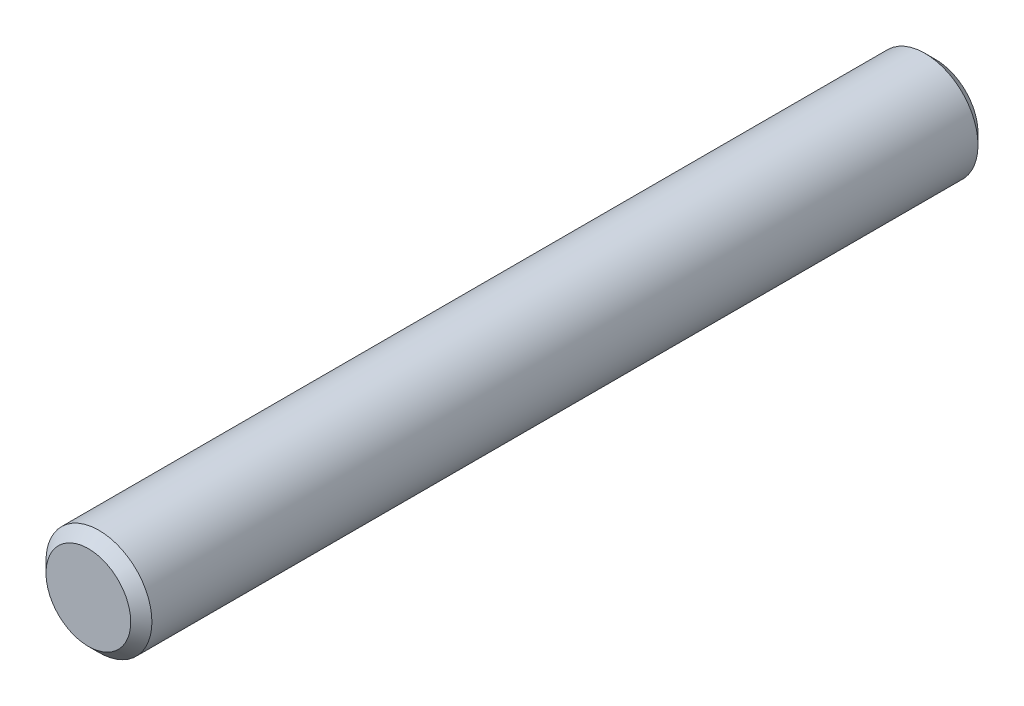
from build123d import *

# Parameters (mm, degrees)
AUFSATZ_LINEAR_AUSTRAGEN1_DEPTH      = 8
AUFSATZ_LINEAR_AUSTRAGEN1_DEPTH_BACK = 8
SKIZZE1_R                            = 1
FASE1_SIZE                           = 0.2


with BuildPart() as part:
    # Skizze1 → Aufsatz-Linear austragen1 (new, two sides: drawn at the far end of the back side and taken through both)
    with BuildSketch(Plane.XY.offset(-AUFSATZ_LINEAR_AUSTRAGEN1_DEPTH_BACK)):
        Circle(SKIZZE1_R)
    extrude(amount=AUFSATZ_LINEAR_AUSTRAGEN1_DEPTH + AUFSATZ_LINEAR_AUSTRAGEN1_DEPTH_BACK)

    # Fase1
    fase1_edges = [part.edges().sort_by_distance(p)[0] for p in [
        (-1, 0, -8),
        (-1, 0, 8),
    ]]
    chamfer(fase1_edges, length=FASE1_SIZE)


solid = part.part
